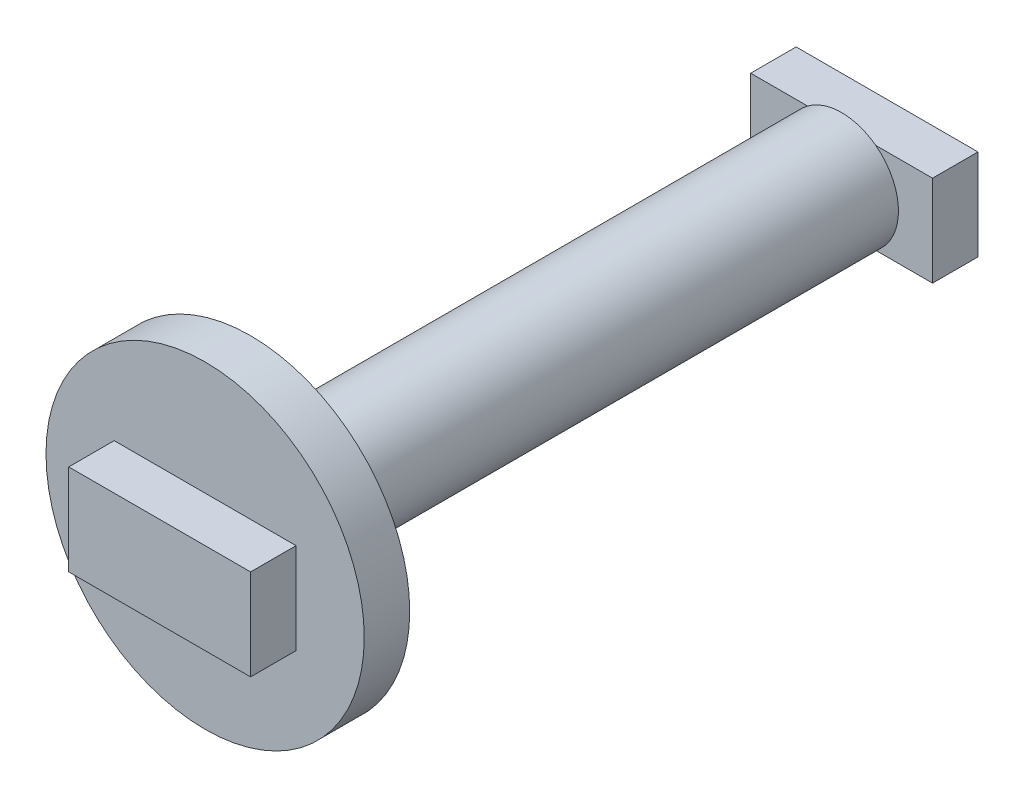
from build123d import *

# Parameters (mm, degrees)
SKETCH1_R           = 12.5
BOSS_EXTRUDE1_DEPTH = 130
SKETCH2_R           = 35
BOSS_EXTRUDE2_DEPTH = 10
SKETCH3_W           = 40
SKETCH3_H           = 20
BOSS_EXTRUDE3_DEPTH = 10
SKETCH4_W           = 40
SKETCH4_H           = 20
BOSS_EXTRUDE4_DEPTH = 10


with BuildPart() as part:
    # Sketch1 → Boss-Extrude1 (new body)
    with BuildSketch(Plane.XY):
        Circle(SKETCH1_R)
    extrude(amount=BOSS_EXTRUDE1_DEPTH)

    # Sketch2 → Boss-Extrude2 (add)
    with BuildSketch(Plane.XY.offset(130)):
        Circle(SKETCH2_R)
    extrude(amount=BOSS_EXTRUDE2_DEPTH)

    # Sketch3 → Boss-Extrude3 (add)
    with BuildSketch(Plane.XY.offset(140)):
        Rectangle(SKETCH3_W, SKETCH3_H)
    extrude(amount=BOSS_EXTRUDE3_DEPTH)

    # Sketch4 → Boss-Extrude4 (add)
    with BuildSketch(Plane(origin=(0, 0, 0), x_dir=(-1, 0, 0), z_dir=(0, 0, -1))):
        Rectangle(SKETCH4_W, SKETCH4_H)
    extrude(amount=BOSS_EXTRUDE4_DEPTH)


solid = part.part
